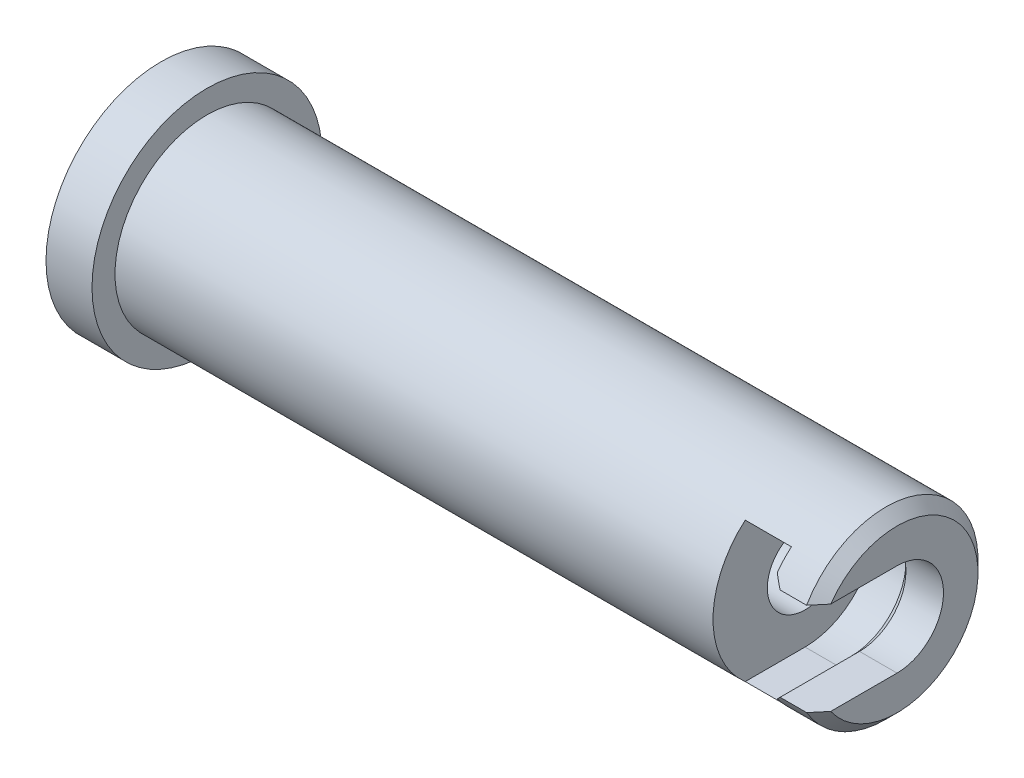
from build123d import *

# Parameters (mm, degrees)
CUT_EXTRUDE1_DEPTH = 15.875


with BuildPart() as part:
    # Sketch1 → Revolve1 (revolve)
    with BuildSketch(Plane.XY, mode=Mode.PRIVATE) as revolve1_sk:
        Polygon((0, 15.875), (0, 6.731), (1.524, 5.207), (88.9, 5.207), (88.9, 9.652), (95.2754, 9.652), (95.2754, 7.5565), (96.4184, 6.4135), (101.6, 6.4135), (101.6, 11.176), (100.076, 12.7), (6.35, 12.7), (6.35, 15.875), align=None)
    revolve(revolve1_sk.sketch.rotate(Axis((63.5, 0, 0), (-1, 0, 0)), 180), axis=Axis((63.5, 0, 0), (-1, 0, 0)))

    # Sketch2 → Cut-Extrude1 (cut)
    with BuildSketch(Plane.XY):
        Polygon((88.9, -9.652), (95.2754, -9.652), (95.2754, -7.5565), (96.4184, -6.4135), (101.6, -6.4135), (101.6, 6.4135), (96.4184, 6.4135), (95.2754, 7.5565), (95.2754, 9.652), (88.9, 9.652), align=None)
    extrude(amount=CUT_EXTRUDE1_DEPTH, mode=Mode.SUBTRACT)


solid = part.part
